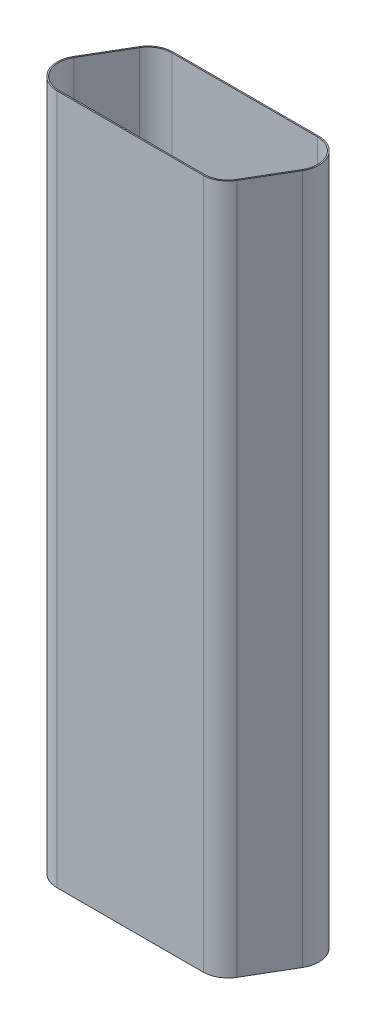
ISO-10303-21;
HEADER;
FILE_DESCRIPTION(('STEP AP214'),'2;1');
FILE_NAME('part.step','',(''),(''),'','','');
FILE_SCHEMA(('AUTOMOTIVE_DESIGN { 1 0 10303 214 1 1 1 1 }'));
ENDSEC;
DATA;
#1=APPLICATION_CONTEXT('core data for automotive mechanical design processes');
#2=APPLICATION_PROTOCOL_DEFINITION('international standard','automotive_design',2000,#1);
#3=PRODUCT_CONTEXT('',#1,'mechanical');
#4=PRODUCT('Part','Part','',(#3));
#5=PRODUCT_RELATED_PRODUCT_CATEGORY('part','',(#4));
#6=PRODUCT_DEFINITION_FORMATION('','',#4);
#7=PRODUCT_DEFINITION_CONTEXT('part definition',#1,'design');
#8=PRODUCT_DEFINITION('design','',#6,#7);
#9=PRODUCT_DEFINITION_SHAPE('','',#8);
#10=(LENGTH_UNIT() NAMED_UNIT(*) SI_UNIT(.MILLI.,.METRE.));
#11=(NAMED_UNIT(*) PLANE_ANGLE_UNIT() SI_UNIT($,.RADIAN.));
#12=(NAMED_UNIT(*) SI_UNIT($,.STERADIAN.) SOLID_ANGLE_UNIT());
#13=UNCERTAINTY_MEASURE_WITH_UNIT(LENGTH_MEASURE(1.E-05),#10,'distance_accuracy_value','');
#14=(GEOMETRIC_REPRESENTATION_CONTEXT(3) GLOBAL_UNCERTAINTY_ASSIGNED_CONTEXT((#13)) GLOBAL_UNIT_ASSIGNED_CONTEXT((#10,
#11,#12)) REPRESENTATION_CONTEXT('',''));
#15=CARTESIAN_POINT('',(0.,0.,0.));
#16=DIRECTION('',(0.,0.,1.));
#17=DIRECTION('',(1.,0.,0.));
#18=AXIS2_PLACEMENT_3D('',#15,#16,#17);
#19=CARTESIAN_POINT('',(73.0320842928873,353.947146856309,-10.8625272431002));
#20=DIRECTION('',(-0.862034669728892,0.,-0.506849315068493));
#21=DIRECTION('',(-0.506849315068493,0.,0.862034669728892));
#22=AXIS2_PLACEMENT_3D('',#19,#20,#21);
#23=PLANE('',#22);
#24=DIRECTION('',(0.506849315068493,0.,-0.862034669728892));
#25=VECTOR('',#24,1.);
#26=CARTESIAN_POINT('',(73.0320842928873,263.,-10.8625272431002));
#27=LINE('',#26,#25);
#28=CARTESIAN_POINT('',(63.7820842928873,263.,4.86960547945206));
#29=VERTEX_POINT('',#28);
#30=CARTESIAN_POINT('',(73.0320842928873,263.,-10.8625272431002));
#31=VERTEX_POINT('',#30);
#32=EDGE_CURVE('E354',#29,#31,#27,.T.);
#33=ORIENTED_EDGE('',*,*,#32,.F.);
#34=DIRECTION('',(0.,-1.,0.));
#35=VECTOR('',#34,1.);
#36=CARTESIAN_POINT('',(63.7820842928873,353.947146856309,4.86960547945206));
#37=LINE('',#36,#35);
#38=CARTESIAN_POINT('',(63.7820842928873,0.,4.86960547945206));
#39=VERTEX_POINT('',#38);
#40=EDGE_CURVE('E54',#29,#39,#37,.T.);
#41=ORIENTED_EDGE('',*,*,#40,.T.);
#42=DIRECTION('',(0.506849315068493,0.,-0.862034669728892));
#43=VECTOR('',#42,1.);
#44=CARTESIAN_POINT('',(73.0320842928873,0.,-10.8625272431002));
#45=LINE('',#44,#43);
#46=CARTESIAN_POINT('',(73.0320842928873,0.,-10.8625272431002));
#47=VERTEX_POINT('',#46);
#48=EDGE_CURVE('E229',#39,#47,#45,.T.);
#49=ORIENTED_EDGE('',*,*,#48,.T.);
#50=DIRECTION('',(0.,-1.,0.));
#51=VECTOR('',#50,1.);
#52=CARTESIAN_POINT('',(73.0320842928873,353.947146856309,-10.8625272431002));
#53=LINE('',#52,#51);
#54=EDGE_CURVE('E233',#31,#47,#53,.T.);
#55=ORIENTED_EDGE('',*,*,#54,.F.);
#56=EDGE_LOOP('',(#33,#41,#49,#55));
#57=FACE_BOUND('',#56,.T.);
#58=ADVANCED_FACE('F38',(#57),#23,.F.);
#59=CARTESIAN_POINT('',(55.5,353.947146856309,0.));
#60=DIRECTION('',(0.,-1.,0.));
#61=DIRECTION('',(0.,0.,-1.));
#62=AXIS2_PLACEMENT_3D('',#59,#60,#61);
#63=CYLINDRICAL_SURFACE('',#62,9.60760000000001);
#64=CARTESIAN_POINT('',(55.5,263.,0.));
#65=DIRECTION('',(0.,1.,0.));
#66=DIRECTION('',(0.,0.,1.));
#67=AXIS2_PLACEMENT_3D('',#64,#65,#66);
#68=CIRCLE('',#67,9.60760000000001);
#69=CARTESIAN_POINT('',(55.6828933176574,263.,9.60585903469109));
#70=VERTEX_POINT('',#69);
#71=EDGE_CURVE('E278',#70,#29,#68,.T.);
#72=ORIENTED_EDGE('',*,*,#71,.F.);
#73=DIRECTION('',(0.,-1.,0.));
#74=VECTOR('',#73,1.);
#75=CARTESIAN_POINT('',(55.6828933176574,353.947146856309,9.60585903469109));
#76=LINE('',#75,#74);
#77=CARTESIAN_POINT('',(55.6828933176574,0.,9.60585903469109));
#78=VERTEX_POINT('',#77);
#79=EDGE_CURVE('E237',#70,#78,#76,.T.);
#80=ORIENTED_EDGE('',*,*,#79,.T.);
#81=CARTESIAN_POINT('',(55.5,0.,0.));
#82=DIRECTION('',(0.,1.,0.));
#83=DIRECTION('',(0.,0.,-1.));
#84=AXIS2_PLACEMENT_3D('',#81,#82,#83);
#85=CIRCLE('',#84,9.60760000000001);
#86=EDGE_CURVE('E226',#78,#39,#85,.T.);
#87=ORIENTED_EDGE('',*,*,#86,.T.);
#88=ORIENTED_EDGE('',*,*,#40,.F.);
#89=EDGE_LOOP('',(#72,#80,#87,#88));
#90=FACE_BOUND('',#89,.T.);
#91=ADVANCED_FACE('F275',(#90),#63,.T.);
#92=CARTESIAN_POINT('',(55.6828933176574,353.947146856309,9.60585903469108));
#93=DIRECTION('',(-8.79592757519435E-06,0.,-0.999999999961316));
#94=DIRECTION('',(-0.999999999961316,0.,8.79592757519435E-06));
#95=AXIS2_PLACEMENT_3D('',#92,#93,#94);
#96=PLANE('',#95);
#97=DIRECTION('',(0.999999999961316,0.,-8.79592757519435E-06));
#98=VECTOR('',#97,1.);
#99=CARTESIAN_POINT('',(55.6828933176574,263.,9.60585903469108));
#100=LINE('',#99,#98);
#101=CARTESIAN_POINT('',(-0.154964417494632,263.,9.60635018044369));
#102=VERTEX_POINT('',#101);
#103=EDGE_CURVE('E283',#102,#70,#100,.T.);
#104=ORIENTED_EDGE('',*,*,#103,.F.);
#105=DIRECTION('',(0.,-1.,0.));
#106=VECTOR('',#105,1.);
#107=CARTESIAN_POINT('',(-0.154964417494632,353.947146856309,9.60635018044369));
#108=LINE('',#107,#106);
#109=CARTESIAN_POINT('',(-0.154964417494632,0.,9.60635018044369));
#110=VERTEX_POINT('',#109);
#111=EDGE_CURVE('E240',#102,#110,#108,.T.);
#112=ORIENTED_EDGE('',*,*,#111,.T.);
#113=DIRECTION('',(0.999999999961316,0.,-8.79592757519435E-06));
#114=VECTOR('',#113,1.);
#115=CARTESIAN_POINT('',(55.6828933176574,0.,9.60585903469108));
#116=LINE('',#115,#114);
#117=EDGE_CURVE('E222',#110,#78,#116,.T.);
#118=ORIENTED_EDGE('',*,*,#117,.T.);
#119=ORIENTED_EDGE('',*,*,#79,.F.);
#120=EDGE_LOOP('',(#104,#112,#118,#119));
#121=FACE_BOUND('',#120,.T.);
#122=ADVANCED_FACE('F281',(#121),#96,.F.);
#123=CARTESIAN_POINT('',(0.,353.947146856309,0.));
#124=DIRECTION('',(0.,-1.,0.));
#125=DIRECTION('',(0.,0.,-1.));
#126=AXIS2_PLACEMENT_3D('',#123,#124,#125);
#127=CYLINDRICAL_SURFACE('',#126,9.6076);
#128=CARTESIAN_POINT('',(0.,263.,0.));
#129=DIRECTION('',(0.,1.,0.));
#130=DIRECTION('',(0.,0.,1.));
#131=AXIS2_PLACEMENT_3D('',#128,#129,#130);
#132=CIRCLE('',#131,9.6076);
#133=CARTESIAN_POINT('',(-8.28208429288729,263.,-4.86960547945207));
#134=VERTEX_POINT('',#133);
#135=EDGE_CURVE('E360',#134,#102,#132,.T.);
#136=ORIENTED_EDGE('',*,*,#135,.F.);
#137=DIRECTION('',(0.,-1.,0.));
#138=VECTOR('',#137,1.);
#139=CARTESIAN_POINT('',(-8.28208429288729,353.947146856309,-4.86960547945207));
#140=LINE('',#139,#138);
#141=CARTESIAN_POINT('',(-8.28208429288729,0.,-4.86960547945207));
#142=VERTEX_POINT('',#141);
#143=EDGE_CURVE('E243',#134,#142,#140,.T.);
#144=ORIENTED_EDGE('',*,*,#143,.T.);
#145=CARTESIAN_POINT('',(0.,0.,0.));
#146=DIRECTION('',(0.,1.,0.));
#147=DIRECTION('',(0.,0.,1.));
#148=AXIS2_PLACEMENT_3D('',#145,#146,#147);
#149=CIRCLE('',#148,9.6076);
#150=EDGE_CURVE('E218',#142,#110,#149,.T.);
#151=ORIENTED_EDGE('',*,*,#150,.T.);
#152=ORIENTED_EDGE('',*,*,#111,.F.);
#153=EDGE_LOOP('',(#136,#144,#151,#152));
#154=FACE_BOUND('',#153,.T.);
#155=ADVANCED_FACE('F286',(#154),#127,.T.);
#156=CARTESIAN_POINT('',(0.967915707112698,353.947146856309,-20.6017382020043));
#157=DIRECTION('',(0.862034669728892,0.,0.506849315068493));
#158=DIRECTION('',(0.506849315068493,0.,-0.862034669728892));
#159=AXIS2_PLACEMENT_3D('',#156,#157,#158);
#160=PLANE('',#159);
#161=DIRECTION('',(-0.506849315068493,0.,0.862034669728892));
#162=VECTOR('',#161,1.);
#163=CARTESIAN_POINT('',(0.967915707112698,263.,-20.6017382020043));
#164=LINE('',#163,#162);
#165=CARTESIAN_POINT('',(0.967915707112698,263.,-20.6017382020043));
#166=VERTEX_POINT('',#165);
#167=EDGE_CURVE('E292',#166,#134,#164,.T.);
#168=ORIENTED_EDGE('',*,*,#167,.F.);
#169=DIRECTION('',(0.,-1.,0.));
#170=VECTOR('',#169,1.);
#171=CARTESIAN_POINT('',(0.967915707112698,353.947146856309,-20.6017382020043));
#172=LINE('',#171,#170);
#173=CARTESIAN_POINT('',(0.967915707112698,0.,-20.6017382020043));
#174=VERTEX_POINT('',#173);
#175=EDGE_CURVE('E246',#166,#174,#172,.T.);
#176=ORIENTED_EDGE('',*,*,#175,.T.);
#177=DIRECTION('',(-0.506849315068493,0.,0.862034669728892));
#178=VECTOR('',#177,1.);
#179=CARTESIAN_POINT('',(0.967915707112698,0.,-20.6017382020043));
#180=LINE('',#179,#178);
#181=EDGE_CURVE('E215',#174,#142,#180,.T.);
#182=ORIENTED_EDGE('',*,*,#181,.T.);
#183=ORIENTED_EDGE('',*,*,#143,.F.);
#184=EDGE_LOOP('',(#168,#176,#182,#183));
#185=FACE_BOUND('',#184,.T.);
#186=ADVANCED_FACE('F289',(#185),#160,.F.);
#187=CARTESIAN_POINT('',(9.25,353.947146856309,-15.7321327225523));
#188=DIRECTION('',(0.,-1.,0.));
#189=DIRECTION('',(0.,0.,-1.));
#190=AXIS2_PLACEMENT_3D('',#187,#188,#189);
#191=CYLINDRICAL_SURFACE('',#190,9.6076);
#192=CARTESIAN_POINT('',(9.25,263.,-15.7321327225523));
#193=DIRECTION('',(0.,1.,0.));
#194=DIRECTION('',(0.,0.,1.));
#195=AXIS2_PLACEMENT_3D('',#192,#193,#194);
#196=CIRCLE('',#195,9.6076);
#197=CARTESIAN_POINT('',(9.25,263.,-25.3397327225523));
#198=VERTEX_POINT('',#197);
#199=EDGE_CURVE('E296',#198,#166,#196,.T.);
#200=ORIENTED_EDGE('',*,*,#199,.F.);
#201=DIRECTION('',(0.,-1.,0.));
#202=VECTOR('',#201,1.);
#203=CARTESIAN_POINT('',(9.25,353.947146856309,-25.3397327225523));
#204=LINE('',#203,#202);
#205=CARTESIAN_POINT('',(9.25,0.,-25.3397327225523));
#206=VERTEX_POINT('',#205);
#207=EDGE_CURVE('E249',#198,#206,#204,.T.);
#208=ORIENTED_EDGE('',*,*,#207,.T.);
#209=CARTESIAN_POINT('',(9.25,0.,-15.7321327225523));
#210=DIRECTION('',(0.,1.,0.));
#211=DIRECTION('',(0.,0.,1.));
#212=AXIS2_PLACEMENT_3D('',#209,#210,#211);
#213=CIRCLE('',#212,9.6076);
#214=EDGE_CURVE('E211',#206,#174,#213,.T.);
#215=ORIENTED_EDGE('',*,*,#214,.T.);
#216=ORIENTED_EDGE('',*,*,#175,.F.);
#217=EDGE_LOOP('',(#200,#208,#215,#216));
#218=FACE_BOUND('',#217,.T.);
#219=ADVANCED_FACE('F295',(#218),#191,.T.);
#220=CARTESIAN_POINT('',(64.75,353.947146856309,-25.3397327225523));
#221=DIRECTION('',(0.,0.,1.));
#222=DIRECTION('',(1.,0.,0.));
#223=AXIS2_PLACEMENT_3D('',#220,#221,#222);
#224=PLANE('',#223);
#225=DIRECTION('',(-1.,0.,0.));
#226=VECTOR('',#225,1.);
#227=CARTESIAN_POINT('',(64.75,263.,-25.3397327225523));
#228=LINE('',#227,#226);
#229=CARTESIAN_POINT('',(64.75,263.,-25.3397327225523));
#230=VERTEX_POINT('',#229);
#231=EDGE_CURVE('E259',#230,#198,#228,.T.);
#232=ORIENTED_EDGE('',*,*,#231,.F.);
#233=DIRECTION('',(0.,-1.,0.));
#234=VECTOR('',#233,1.);
#235=CARTESIAN_POINT('',(64.75,353.947146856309,-25.3397327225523));
#236=LINE('',#235,#234);
#237=CARTESIAN_POINT('',(64.75,0.,-25.3397327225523));
#238=VERTEX_POINT('',#237);
#239=EDGE_CURVE('E47',#230,#238,#236,.T.);
#240=ORIENTED_EDGE('',*,*,#239,.T.);
#241=DIRECTION('',(-1.,0.,0.));
#242=VECTOR('',#241,1.);
#243=CARTESIAN_POINT('',(64.75,0.,-25.3397327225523));
#244=LINE('',#243,#242);
#245=EDGE_CURVE('E207',#238,#206,#244,.T.);
#246=ORIENTED_EDGE('',*,*,#245,.T.);
#247=ORIENTED_EDGE('',*,*,#207,.F.);
#248=EDGE_LOOP('',(#232,#240,#246,#247));
#249=FACE_BOUND('',#248,.T.);
#250=ADVANCED_FACE('F255',(#249),#224,.F.);
#251=CARTESIAN_POINT('',(64.75,353.947146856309,-15.7321327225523));
#252=DIRECTION('',(0.,-1.,0.));
#253=DIRECTION('',(0.,0.,-1.));
#254=AXIS2_PLACEMENT_3D('',#251,#252,#253);
#255=CYLINDRICAL_SURFACE('',#254,9.60760000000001);
#256=CARTESIAN_POINT('',(64.75,263.,-15.7321327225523));
#257=DIRECTION('',(0.,1.,0.));
#258=DIRECTION('',(0.,0.,1.));
#259=AXIS2_PLACEMENT_3D('',#256,#257,#258);
#260=CIRCLE('',#259,9.60760000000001);
#261=EDGE_CURVE('E269',#31,#230,#260,.T.);
#262=ORIENTED_EDGE('',*,*,#261,.F.);
#263=ORIENTED_EDGE('',*,*,#54,.T.);
#264=CARTESIAN_POINT('',(64.75,0.,-15.7321327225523));
#265=DIRECTION('',(0.,1.,0.));
#266=DIRECTION('',(0.,0.,1.));
#267=AXIS2_PLACEMENT_3D('',#264,#265,#266);
#268=CIRCLE('',#267,9.60760000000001);
#269=EDGE_CURVE('E204',#47,#238,#268,.T.);
#270=ORIENTED_EDGE('',*,*,#269,.T.);
#271=ORIENTED_EDGE('',*,*,#239,.F.);
#272=EDGE_LOOP('',(#262,#263,#270,#271));
#273=FACE_BOUND('',#272,.T.);
#274=ADVANCED_FACE('F40',(#273),#255,.T.);
#275=CARTESIAN_POINT('',(64.75,0.,-15.7321327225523));
#276=DIRECTION('',(0.,1.,0.));
#277=DIRECTION('',(0.,0.,1.));
#278=AXIS2_PLACEMENT_3D('',#275,#276,#277);
#279=PLANE('',#278);
#280=ORIENTED_EDGE('',*,*,#269,.F.);
#281=ORIENTED_EDGE('',*,*,#48,.F.);
#282=ORIENTED_EDGE('',*,*,#86,.F.);
#283=ORIENTED_EDGE('',*,*,#117,.F.);
#284=ORIENTED_EDGE('',*,*,#150,.F.);
#285=ORIENTED_EDGE('',*,*,#181,.F.);
#286=ORIENTED_EDGE('',*,*,#214,.F.);
#287=ORIENTED_EDGE('',*,*,#245,.F.);
#288=EDGE_LOOP('',(#280,#281,#282,#283,#284,#285,#286,#287));
#289=FACE_BOUND('',#288,.T.);
#290=CARTESIAN_POINT('',(0.,0.,0.));
#291=DIRECTION('',(0.,1.,0.));
#292=DIRECTION('',(0.,0.,1.));
#293=AXIS2_PLACEMENT_3D('',#290,#291,#292);
#294=CIRCLE('',#293,9.125);
#295=CARTESIAN_POINT('',(-7.86606636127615,0.,-4.625));
#296=VERTEX_POINT('',#295);
#297=CARTESIAN_POINT('',(0.,0.,9.125));
#298=VERTEX_POINT('',#297);
#299=EDGE_CURVE('E301',#296,#298,#294,.T.);
#300=ORIENTED_EDGE('',*,*,#299,.T.);
#301=DIRECTION('',(1.,0.,0.));
#302=VECTOR('',#301,1.);
#303=CARTESIAN_POINT('',(0.,0.,9.125));
#304=LINE('',#303,#302);
#305=CARTESIAN_POINT('',(55.5,0.,9.12500000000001));
#306=VERTEX_POINT('',#305);
#307=EDGE_CURVE('E310',#298,#306,#304,.T.);
#308=ORIENTED_EDGE('',*,*,#307,.T.);
#309=CARTESIAN_POINT('',(55.5,0.,0.));
#310=DIRECTION('',(0.,1.,0.));
#311=DIRECTION('',(0.,0.,-1.));
#312=AXIS2_PLACEMENT_3D('',#309,#310,#311);
#313=CIRCLE('',#312,9.12500000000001);
#314=CARTESIAN_POINT('',(63.3660663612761,0.,4.62500000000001));
#315=VERTEX_POINT('',#314);
#316=EDGE_CURVE('E314',#306,#315,#313,.T.);
#317=ORIENTED_EDGE('',*,*,#316,.T.);
#318=DIRECTION('',(0.506849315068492,0.,-0.862034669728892));
#319=VECTOR('',#318,1.);
#320=CARTESIAN_POINT('',(72.6160663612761,0.,-11.1071327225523));
#321=LINE('',#320,#319);
#322=CARTESIAN_POINT('',(72.6160663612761,0.,-11.1071327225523));
#323=VERTEX_POINT('',#322);
#324=EDGE_CURVE('E317',#315,#323,#321,.T.);
#325=ORIENTED_EDGE('',*,*,#324,.T.);
#326=CARTESIAN_POINT('',(64.75,0.,-15.7321327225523));
#327=DIRECTION('',(0.,1.,0.));
#328=DIRECTION('',(0.,0.,1.));
#329=AXIS2_PLACEMENT_3D('',#326,#327,#328);
#330=CIRCLE('',#329,9.125);
#331=CARTESIAN_POINT('',(64.75,0.,-24.8571327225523));
#332=VERTEX_POINT('',#331);
#333=EDGE_CURVE('E321',#323,#332,#330,.T.);
#334=ORIENTED_EDGE('',*,*,#333,.T.);
#335=DIRECTION('',(-1.,0.,0.));
#336=VECTOR('',#335,1.);
#337=CARTESIAN_POINT('',(64.75,0.,-24.8571327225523));
#338=LINE('',#337,#336);
#339=CARTESIAN_POINT('',(9.25,0.,-24.8571327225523));
#340=VERTEX_POINT('',#339);
#341=EDGE_CURVE('E324',#332,#340,#338,.T.);
#342=ORIENTED_EDGE('',*,*,#341,.T.);
#343=CARTESIAN_POINT('',(9.25,0.,-15.7321327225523));
#344=DIRECTION('',(0.,1.,0.));
#345=DIRECTION('',(0.,0.,1.));
#346=AXIS2_PLACEMENT_3D('',#343,#344,#345);
#347=CIRCLE('',#346,9.125);
#348=CARTESIAN_POINT('',(1.38393363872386,0.,-20.3571327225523));
#349=VERTEX_POINT('',#348);
#350=EDGE_CURVE('E328',#340,#349,#347,.T.);
#351=ORIENTED_EDGE('',*,*,#350,.T.);
#352=DIRECTION('',(-0.506849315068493,0.,0.862034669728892));
#353=VECTOR('',#352,1.);
#354=CARTESIAN_POINT('',(1.38393363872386,0.,-20.3571327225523));
#355=LINE('',#354,#353);
#356=EDGE_CURVE('E178',#349,#296,#355,.T.);
#357=ORIENTED_EDGE('',*,*,#356,.T.);
#358=EDGE_LOOP('',(#300,#308,#317,#325,#334,#342,#351,#357));
#359=FACE_BOUND('',#358,.T.);
#360=ADVANCED_FACE('F265',(#289,#359),#279,.F.);
#361=CARTESIAN_POINT('',(1.38393363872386,353.947146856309,-20.3571327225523));
#362=DIRECTION('',(0.862034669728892,0.,0.506849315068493));
#363=DIRECTION('',(0.506849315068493,0.,-0.862034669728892));
#364=AXIS2_PLACEMENT_3D('',#361,#362,#363);
#365=PLANE('',#364);
#366=DIRECTION('',(0.,-1.,0.));
#367=VECTOR('',#366,1.);
#368=CARTESIAN_POINT('',(1.38393363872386,353.947146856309,-20.3571327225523));
#369=LINE('',#368,#367);
#370=CARTESIAN_POINT('',(1.38393363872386,263.,-20.3571327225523));
#371=VERTEX_POINT('',#370);
#372=EDGE_CURVE('E169',#371,#349,#369,.T.);
#373=ORIENTED_EDGE('',*,*,#372,.F.);
#374=DIRECTION('',(-0.506849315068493,0.,0.862034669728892));
#375=VECTOR('',#374,1.);
#376=CARTESIAN_POINT('',(1.38393363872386,263.,-20.3571327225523));
#377=LINE('',#376,#375);
#378=CARTESIAN_POINT('',(-7.86606636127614,263.,-4.625));
#379=VERTEX_POINT('',#378);
#380=EDGE_CURVE('E11',#371,#379,#377,.T.);
#381=ORIENTED_EDGE('',*,*,#380,.T.);
#382=DIRECTION('',(0.,-1.,0.));
#383=VECTOR('',#382,1.);
#384=CARTESIAN_POINT('',(-7.86606636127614,353.947146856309,-4.625));
#385=LINE('',#384,#383);
#386=EDGE_CURVE('E181',#379,#296,#385,.T.);
#387=ORIENTED_EDGE('',*,*,#386,.T.);
#388=ORIENTED_EDGE('',*,*,#356,.F.);
#389=EDGE_LOOP('',(#373,#381,#387,#388));
#390=FACE_BOUND('',#389,.T.);
#391=ADVANCED_FACE('F176',(#390),#365,.T.);
#392=CARTESIAN_POINT('',(9.25,353.947146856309,-15.7321327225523));
#393=DIRECTION('',(0.,-1.,0.));
#394=DIRECTION('',(0.,0.,-1.));
#395=AXIS2_PLACEMENT_3D('',#392,#393,#394);
#396=CYLINDRICAL_SURFACE('',#395,9.125);
#397=DIRECTION('',(0.,-1.,0.));
#398=VECTOR('',#397,1.);
#399=CARTESIAN_POINT('',(9.25,353.947146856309,-24.8571327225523));
#400=LINE('',#399,#398);
#401=CARTESIAN_POINT('',(9.25,263.,-24.8571327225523));
#402=VERTEX_POINT('',#401);
#403=EDGE_CURVE('E171',#402,#340,#400,.T.);
#404=ORIENTED_EDGE('',*,*,#403,.F.);
#405=CARTESIAN_POINT('',(9.25,263.,-15.7321327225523));
#406=DIRECTION('',(0.,1.,0.));
#407=DIRECTION('',(0.,0.,1.));
#408=AXIS2_PLACEMENT_3D('',#405,#406,#407);
#409=CIRCLE('',#408,9.125);
#410=EDGE_CURVE('E162',#402,#371,#409,.T.);
#411=ORIENTED_EDGE('',*,*,#410,.T.);
#412=ORIENTED_EDGE('',*,*,#372,.T.);
#413=ORIENTED_EDGE('',*,*,#350,.F.);
#414=EDGE_LOOP('',(#404,#411,#412,#413));
#415=FACE_BOUND('',#414,.T.);
#416=ADVANCED_FACE('F167',(#415),#396,.F.);
#417=CARTESIAN_POINT('',(64.75,353.947146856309,-24.8571327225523));
#418=DIRECTION('',(0.,0.,1.));
#419=DIRECTION('',(1.,0.,0.));
#420=AXIS2_PLACEMENT_3D('',#417,#418,#419);
#421=PLANE('',#420);
#422=DIRECTION('',(0.,-1.,0.));
#423=VECTOR('',#422,1.);
#424=CARTESIAN_POINT('',(64.75,353.947146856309,-24.8571327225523));
#425=LINE('',#424,#423);
#426=CARTESIAN_POINT('',(64.75,263.,-24.8571327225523));
#427=VERTEX_POINT('',#426);
#428=EDGE_CURVE('E185',#427,#332,#425,.T.);
#429=ORIENTED_EDGE('',*,*,#428,.F.);
#430=DIRECTION('',(-1.,0.,0.));
#431=VECTOR('',#430,1.);
#432=CARTESIAN_POINT('',(64.75,263.,-24.8571327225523));
#433=LINE('',#432,#431);
#434=EDGE_CURVE('E174',#427,#402,#433,.T.);
#435=ORIENTED_EDGE('',*,*,#434,.T.);
#436=ORIENTED_EDGE('',*,*,#403,.T.);
#437=ORIENTED_EDGE('',*,*,#341,.F.);
#438=EDGE_LOOP('',(#429,#435,#436,#437));
#439=FACE_BOUND('',#438,.T.);
#440=ADVANCED_FACE('F335',(#439),#421,.T.);
#441=CARTESIAN_POINT('',(64.75,353.947146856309,-15.7321327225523));
#442=DIRECTION('',(0.,-1.,0.));
#443=DIRECTION('',(0.,0.,-1.));
#444=AXIS2_PLACEMENT_3D('',#441,#442,#443);
#445=CYLINDRICAL_SURFACE('',#444,9.125);
#446=DIRECTION('',(0.,-1.,0.));
#447=VECTOR('',#446,1.);
#448=CARTESIAN_POINT('',(72.6160663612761,353.947146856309,-11.1071327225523));
#449=LINE('',#448,#447);
#450=CARTESIAN_POINT('',(72.6160663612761,263.,-11.1071327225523));
#451=VERTEX_POINT('',#450);
#452=EDGE_CURVE('E193',#451,#323,#449,.T.);
#453=ORIENTED_EDGE('',*,*,#452,.F.);
#454=CARTESIAN_POINT('',(64.75,263.,-15.7321327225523));
#455=DIRECTION('',(0.,1.,0.));
#456=DIRECTION('',(0.,0.,1.));
#457=AXIS2_PLACEMENT_3D('',#454,#455,#456);
#458=CIRCLE('',#457,9.125);
#459=EDGE_CURVE('E337',#451,#427,#458,.T.);
#460=ORIENTED_EDGE('',*,*,#459,.T.);
#461=ORIENTED_EDGE('',*,*,#428,.T.);
#462=ORIENTED_EDGE('',*,*,#333,.F.);
#463=EDGE_LOOP('',(#453,#460,#461,#462));
#464=FACE_BOUND('',#463,.T.);
#465=ADVANCED_FACE('F378',(#464),#445,.F.);
#466=CARTESIAN_POINT('',(72.6160663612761,353.947146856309,-11.1071327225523));
#467=DIRECTION('',(-0.862034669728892,0.,-0.506849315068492));
#468=DIRECTION('',(-0.506849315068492,0.,0.862034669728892));
#469=AXIS2_PLACEMENT_3D('',#466,#467,#468);
#470=PLANE('',#469);
#471=DIRECTION('',(0.,-1.,0.));
#472=VECTOR('',#471,1.);
#473=CARTESIAN_POINT('',(63.3660663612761,353.947146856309,4.62500000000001));
#474=LINE('',#473,#472);
#475=CARTESIAN_POINT('',(63.3660663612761,263.,4.62500000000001));
#476=VERTEX_POINT('',#475);
#477=EDGE_CURVE('E195',#476,#315,#474,.T.);
#478=ORIENTED_EDGE('',*,*,#477,.F.);
#479=DIRECTION('',(0.506849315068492,0.,-0.862034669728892));
#480=VECTOR('',#479,1.);
#481=CARTESIAN_POINT('',(72.6160663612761,263.,-11.1071327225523));
#482=LINE('',#481,#480);
#483=EDGE_CURVE('E340',#476,#451,#482,.T.);
#484=ORIENTED_EDGE('',*,*,#483,.T.);
#485=ORIENTED_EDGE('',*,*,#452,.T.);
#486=ORIENTED_EDGE('',*,*,#324,.F.);
#487=EDGE_LOOP('',(#478,#484,#485,#486));
#488=FACE_BOUND('',#487,.T.);
#489=ADVANCED_FACE('F375',(#488),#470,.T.);
#490=CARTESIAN_POINT('',(55.5,353.947146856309,0.));
#491=DIRECTION('',(0.,-1.,0.));
#492=DIRECTION('',(0.,0.,-1.));
#493=AXIS2_PLACEMENT_3D('',#490,#491,#492);
#494=CYLINDRICAL_SURFACE('',#493,9.12500000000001);
#495=DIRECTION('',(0.,-1.,0.));
#496=VECTOR('',#495,1.);
#497=CARTESIAN_POINT('',(55.5,353.947146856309,9.12500000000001));
#498=LINE('',#497,#496);
#499=CARTESIAN_POINT('',(55.5,263.,9.12500000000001));
#500=VERTEX_POINT('',#499);
#501=EDGE_CURVE('E198',#500,#306,#498,.T.);
#502=ORIENTED_EDGE('',*,*,#501,.F.);
#503=CARTESIAN_POINT('',(55.5,263.,0.));
#504=DIRECTION('',(0.,1.,0.));
#505=DIRECTION('',(0.,0.,1.));
#506=AXIS2_PLACEMENT_3D('',#503,#504,#505);
#507=CIRCLE('',#506,9.12500000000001);
#508=EDGE_CURVE('E345',#500,#476,#507,.T.);
#509=ORIENTED_EDGE('',*,*,#508,.T.);
#510=ORIENTED_EDGE('',*,*,#477,.T.);
#511=ORIENTED_EDGE('',*,*,#316,.F.);
#512=EDGE_LOOP('',(#502,#509,#510,#511));
#513=FACE_BOUND('',#512,.T.);
#514=ADVANCED_FACE('F372',(#513),#494,.F.);
#515=CARTESIAN_POINT('',(0.,353.947146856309,9.125));
#516=DIRECTION('',(0.,0.,-1.));
#517=DIRECTION('',(-1.,0.,0.));
#518=AXIS2_PLACEMENT_3D('',#515,#516,#517);
#519=PLANE('',#518);
#520=DIRECTION('',(0.,-1.,0.));
#521=VECTOR('',#520,1.);
#522=CARTESIAN_POINT('',(0.,353.947146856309,9.125));
#523=LINE('',#522,#521);
#524=CARTESIAN_POINT('',(0.,263.,9.125));
#525=VERTEX_POINT('',#524);
#526=EDGE_CURVE('E201',#525,#298,#523,.T.);
#527=ORIENTED_EDGE('',*,*,#526,.F.);
#528=DIRECTION('',(1.,0.,0.));
#529=VECTOR('',#528,1.);
#530=CARTESIAN_POINT('',(0.,263.,9.125));
#531=LINE('',#530,#529);
#532=EDGE_CURVE('E349',#525,#500,#531,.T.);
#533=ORIENTED_EDGE('',*,*,#532,.T.);
#534=ORIENTED_EDGE('',*,*,#501,.T.);
#535=ORIENTED_EDGE('',*,*,#307,.F.);
#536=EDGE_LOOP('',(#527,#533,#534,#535));
#537=FACE_BOUND('',#536,.T.);
#538=ADVANCED_FACE('F367',(#537),#519,.T.);
#539=CARTESIAN_POINT('',(0.,353.947146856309,0.));
#540=DIRECTION('',(0.,-1.,0.));
#541=DIRECTION('',(0.,0.,-1.));
#542=AXIS2_PLACEMENT_3D('',#539,#540,#541);
#543=CYLINDRICAL_SURFACE('',#542,9.125);
#544=ORIENTED_EDGE('',*,*,#386,.F.);
#545=CARTESIAN_POINT('',(0.,263.,0.));
#546=DIRECTION('',(0.,1.,0.));
#547=DIRECTION('',(0.,0.,1.));
#548=AXIS2_PLACEMENT_3D('',#545,#546,#547);
#549=CIRCLE('',#548,9.125);
#550=EDGE_CURVE('E62',#379,#525,#549,.T.);
#551=ORIENTED_EDGE('',*,*,#550,.T.);
#552=ORIENTED_EDGE('',*,*,#526,.T.);
#553=ORIENTED_EDGE('',*,*,#299,.F.);
#554=EDGE_LOOP('',(#544,#551,#552,#553));
#555=FACE_BOUND('',#554,.T.);
#556=ADVANCED_FACE('F363',(#555),#543,.F.);
#557=CARTESIAN_POINT('',(0.,263.,0.));
#558=DIRECTION('',(0.,1.,0.));
#559=DIRECTION('',(0.,0.,1.));
#560=AXIS2_PLACEMENT_3D('',#557,#558,#559);
#561=PLANE('',#560);
#562=ORIENTED_EDGE('',*,*,#550,.F.);
#563=ORIENTED_EDGE('',*,*,#380,.F.);
#564=ORIENTED_EDGE('',*,*,#410,.F.);
#565=ORIENTED_EDGE('',*,*,#434,.F.);
#566=ORIENTED_EDGE('',*,*,#459,.F.);
#567=ORIENTED_EDGE('',*,*,#483,.F.);
#568=ORIENTED_EDGE('',*,*,#508,.F.);
#569=ORIENTED_EDGE('',*,*,#532,.F.);
#570=EDGE_LOOP('',(#562,#563,#564,#565,#566,#567,#568,#569));
#571=FACE_BOUND('',#570,.T.);
#572=ORIENTED_EDGE('',*,*,#32,.T.);
#573=ORIENTED_EDGE('',*,*,#261,.T.);
#574=ORIENTED_EDGE('',*,*,#231,.T.);
#575=ORIENTED_EDGE('',*,*,#199,.T.);
#576=ORIENTED_EDGE('',*,*,#167,.T.);
#577=ORIENTED_EDGE('',*,*,#135,.T.);
#578=ORIENTED_EDGE('',*,*,#103,.T.);
#579=ORIENTED_EDGE('',*,*,#71,.T.);
#580=EDGE_LOOP('',(#572,#573,#574,#575,#576,#577,#578,#579));
#581=FACE_BOUND('',#580,.T.);
#582=ADVANCED_FACE('F160',(#571,#581),#561,.T.);
#583=CLOSED_SHELL('',(#58,#91,#122,#155,#186,#219,#250,#274,#360,#391,#416,#440,#465,#489,#514,
#538,#556,#582));
#584=MANIFOLD_SOLID_BREP('B2',#583);
#585=ADVANCED_BREP_SHAPE_REPRESENTATION('',(#18,#584),#14);
#586=SHAPE_DEFINITION_REPRESENTATION(#9,#585);
ENDSEC;
END-ISO-10303-21;
